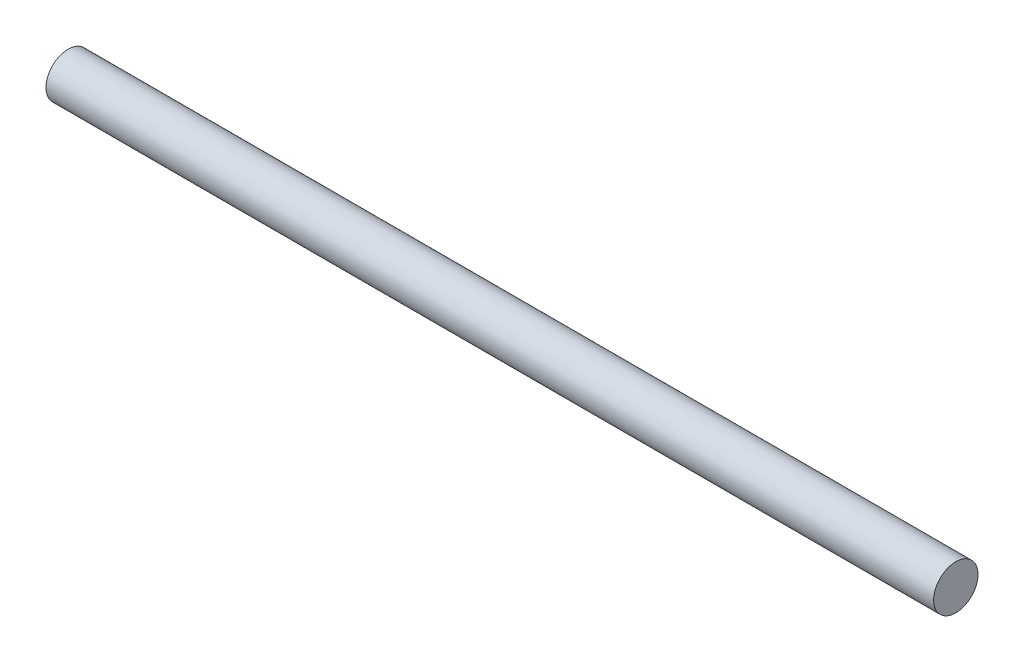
from build123d import *

# Parameters (mm, degrees)
SKETCH2_R           = 3.175
BOSS_EXTRUDE1_DEPTH = 63.5


with BuildPart() as part:
    # Sketch2 → Boss-Extrude1 (new, symmetric)
    with BuildSketch(Plane(origin=(0, 0, 0), x_dir=(0, 0, -1), z_dir=(1, 0, 0))):
        Circle(SKETCH2_R)
    extrude(amount=BOSS_EXTRUDE1_DEPTH, both=True)


solid = part.part
